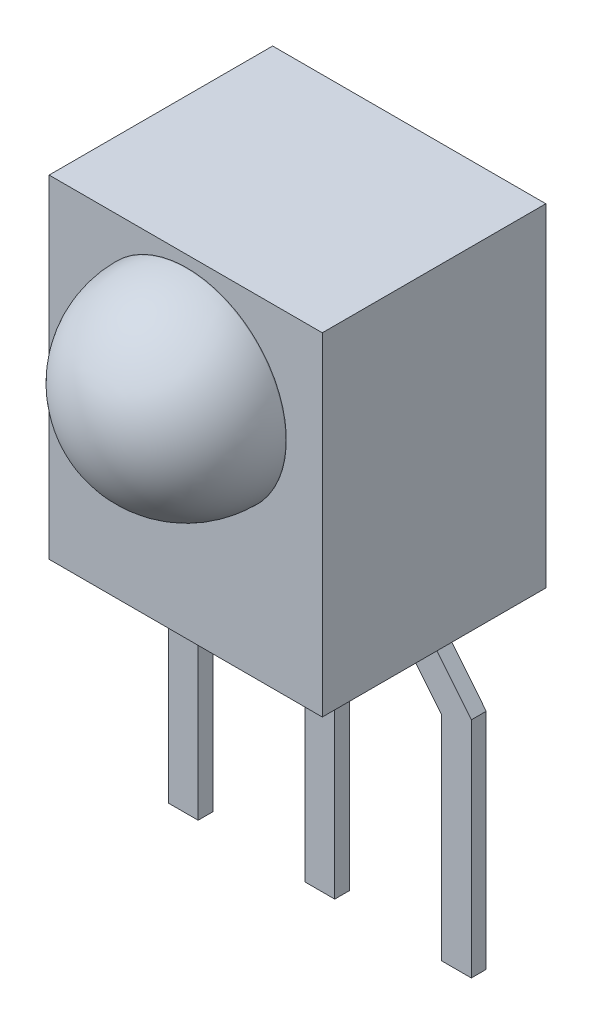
ISO-10303-21;
HEADER;
FILE_DESCRIPTION(('STEP AP214'),'2;1');
FILE_NAME('part.step','',(''),(''),'','','');
FILE_SCHEMA(('AUTOMOTIVE_DESIGN { 1 0 10303 214 1 1 1 1 }'));
ENDSEC;
DATA;
#1=APPLICATION_CONTEXT('core data for automotive mechanical design processes');
#2=APPLICATION_PROTOCOL_DEFINITION('international standard','automotive_design',2000,#1);
#3=PRODUCT_CONTEXT('',#1,'mechanical');
#4=PRODUCT('Part','Part','',(#3));
#5=PRODUCT_RELATED_PRODUCT_CATEGORY('part','',(#4));
#6=PRODUCT_DEFINITION_FORMATION('','',#4);
#7=PRODUCT_DEFINITION_CONTEXT('part definition',#1,'design');
#8=PRODUCT_DEFINITION('design','',#6,#7);
#9=PRODUCT_DEFINITION_SHAPE('','',#8);
#10=(LENGTH_UNIT() NAMED_UNIT(*) SI_UNIT(.MILLI.,.METRE.));
#11=(NAMED_UNIT(*) PLANE_ANGLE_UNIT() SI_UNIT($,.RADIAN.));
#12=(NAMED_UNIT(*) SI_UNIT($,.STERADIAN.) SOLID_ANGLE_UNIT());
#13=UNCERTAINTY_MEASURE_WITH_UNIT(LENGTH_MEASURE(1.E-05),#10,'distance_accuracy_value','');
#14=(GEOMETRIC_REPRESENTATION_CONTEXT(3) GLOBAL_UNCERTAINTY_ASSIGNED_CONTEXT((#13)) GLOBAL_UNIT_ASSIGNED_CONTEXT((#10,
#11,#12)) REPRESENTATION_CONTEXT('',''));
#15=CARTESIAN_POINT('',(0.,0.,0.));
#16=DIRECTION('',(0.,0.,1.));
#17=DIRECTION('',(1.,0.,0.));
#18=AXIS2_PLACEMENT_3D('',#15,#16,#17);
#19=CARTESIAN_POINT('',(-6.31661409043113,6.7,4.5));
#20=DIRECTION('',(0.,0.,-1.));
#21=DIRECTION('',(-1.,0.,0.));
#22=AXIS2_PLACEMENT_3D('',#19,#20,#21);
#23=PLANE('',#22);
#24=DIRECTION('',(0.,-1.,0.));
#25=VECTOR('',#24,1.);
#26=CARTESIAN_POINT('',(-6.31661409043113,0.,4.5));
#27=LINE('',#26,#25);
#28=CARTESIAN_POINT('',(-6.31661409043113,6.7,4.5));
#29=VERTEX_POINT('',#28);
#30=CARTESIAN_POINT('',(-6.31661409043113,0.,4.5));
#31=VERTEX_POINT('',#30);
#32=EDGE_CURVE('E312',#29,#31,#27,.T.);
#33=ORIENTED_EDGE('',*,*,#32,.T.);
#34=DIRECTION('',(1.,0.,0.));
#35=VECTOR('',#34,1.);
#36=CARTESIAN_POINT('',(-6.31661409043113,0.,4.5));
#37=LINE('',#36,#35);
#38=CARTESIAN_POINT('',(-0.816614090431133,0.,4.5));
#39=VERTEX_POINT('',#38);
#40=EDGE_CURVE('E315',#31,#39,#37,.T.);
#41=ORIENTED_EDGE('',*,*,#40,.T.);
#42=DIRECTION('',(0.,1.,0.));
#43=VECTOR('',#42,1.);
#44=CARTESIAN_POINT('',(-0.816614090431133,0.,4.5));
#45=LINE('',#44,#43);
#46=CARTESIAN_POINT('',(-0.816614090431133,6.7,4.5));
#47=VERTEX_POINT('',#46);
#48=EDGE_CURVE('E317',#39,#47,#45,.T.);
#49=ORIENTED_EDGE('',*,*,#48,.T.);
#50=DIRECTION('',(-1.,0.,0.));
#51=VECTOR('',#50,1.);
#52=CARTESIAN_POINT('',(-6.31661409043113,6.7,4.5));
#53=LINE('',#52,#51);
#54=EDGE_CURVE('E319',#47,#29,#53,.T.);
#55=ORIENTED_EDGE('',*,*,#54,.T.);
#56=EDGE_LOOP('',(#33,#41,#49,#55));
#57=FACE_BOUND('',#56,.T.);
#58=CARTESIAN_POINT('',(-3.54146732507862,4.46886413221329,4.5));
#59=DIRECTION('',(0.,0.,-1.));
#60=DIRECTION('',(-1.,0.,0.));
#61=AXIS2_PLACEMENT_3D('',#58,#59,#60);
#62=CIRCLE('',#61,2.);
#63=CARTESIAN_POINT('',(-5.54146732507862,4.46886413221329,4.5));
#64=VERTEX_POINT('',#63);
#65=EDGE_CURVE('E11',#64,#64,#62,.F.);
#66=ORIENTED_EDGE('',*,*,#65,.F.);
#67=EDGE_LOOP('',(#66));
#68=FACE_BOUND('',#67,.T.);
#69=ADVANCED_FACE('F31',(#57,#68),#23,.F.);
#70=CARTESIAN_POINT('',(-6.31661409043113,0.,4.5));
#71=DIRECTION('',(0.,1.,0.));
#72=DIRECTION('',(0.,0.,1.));
#73=AXIS2_PLACEMENT_3D('',#70,#71,#72);
#74=PLANE('',#73);
#75=DIRECTION('',(1.,0.,0.));
#76=VECTOR('',#75,1.);
#77=CARTESIAN_POINT('',(-5.61146018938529,0.,1.8));
#78=LINE('',#77,#76);
#79=CARTESIAN_POINT('',(-5.61146018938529,0.,1.8));
#80=VERTEX_POINT('',#79);
#81=CARTESIAN_POINT('',(-4.84123306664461,0.,1.8));
#82=VERTEX_POINT('',#81);
#83=EDGE_CURVE('E274',#80,#82,#78,.T.);
#84=ORIENTED_EDGE('',*,*,#83,.T.);
#85=DIRECTION('',(0.,0.,-1.));
#86=VECTOR('',#85,1.);
#87=CARTESIAN_POINT('',(-4.84123306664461,0.,1.8));
#88=LINE('',#87,#86);
#89=CARTESIAN_POINT('',(-4.84123306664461,0.,1.5));
#90=VERTEX_POINT('',#89);
#91=EDGE_CURVE('E299',#82,#90,#88,.T.);
#92=ORIENTED_EDGE('',*,*,#91,.T.);
#93=DIRECTION('',(1.,0.,0.));
#94=VECTOR('',#93,1.);
#95=CARTESIAN_POINT('',(-5.61146018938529,0.,1.5));
#96=LINE('',#95,#94);
#97=CARTESIAN_POINT('',(-5.61146018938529,0.,1.5));
#98=VERTEX_POINT('',#97);
#99=EDGE_CURVE('E256',#98,#90,#96,.T.);
#100=ORIENTED_EDGE('',*,*,#99,.F.);
#101=DIRECTION('',(0.,0.,-1.));
#102=VECTOR('',#101,1.);
#103=CARTESIAN_POINT('',(-5.61146018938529,0.,1.8));
#104=LINE('',#103,#102);
#105=EDGE_CURVE('E289',#80,#98,#104,.T.);
#106=ORIENTED_EDGE('',*,*,#105,.F.);
#107=EDGE_LOOP('',(#84,#92,#100,#106));
#108=FACE_BOUND('',#107,.T.);
#109=DIRECTION('',(1.,0.,0.));
#110=VECTOR('',#109,1.);
#111=CARTESIAN_POINT('',(-6.31661409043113,0.,0.));
#112=LINE('',#111,#110);
#113=CARTESIAN_POINT('',(-6.31661409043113,0.,0.));
#114=VERTEX_POINT('',#113);
#115=CARTESIAN_POINT('',(-0.816614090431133,0.,0.));
#116=VERTEX_POINT('',#115);
#117=EDGE_CURVE('E306',#114,#116,#112,.T.);
#118=ORIENTED_EDGE('',*,*,#117,.T.);
#119=DIRECTION('',(0.,0.,-1.));
#120=VECTOR('',#119,1.);
#121=CARTESIAN_POINT('',(-0.816614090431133,0.,4.5));
#122=LINE('',#121,#120);
#123=EDGE_CURVE('E327',#39,#116,#122,.T.);
#124=ORIENTED_EDGE('',*,*,#123,.F.);
#125=ORIENTED_EDGE('',*,*,#40,.F.);
#126=DIRECTION('',(0.,0.,-1.));
#127=VECTOR('',#126,1.);
#128=CARTESIAN_POINT('',(-6.31661409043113,0.,4.5));
#129=LINE('',#128,#127);
#130=EDGE_CURVE('E40',#31,#114,#129,.T.);
#131=ORIENTED_EDGE('',*,*,#130,.T.);
#132=EDGE_LOOP('',(#118,#124,#125,#131));
#133=FACE_BOUND('',#132,.T.);
#134=DIRECTION('',(0.,0.,-1.));
#135=VECTOR('',#134,1.);
#136=CARTESIAN_POINT('',(-2.29199511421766,0.,1.8));
#137=LINE('',#136,#135);
#138=CARTESIAN_POINT('',(-2.29199511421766,0.,1.8));
#139=VERTEX_POINT('',#138);
#140=CARTESIAN_POINT('',(-2.29199511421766,0.,1.5));
#141=VERTEX_POINT('',#140);
#142=EDGE_CURVE('E245',#139,#141,#137,.T.);
#143=ORIENTED_EDGE('',*,*,#142,.F.);
#144=DIRECTION('',(1.,0.,0.));
#145=VECTOR('',#144,1.);
#146=CARTESIAN_POINT('',(-1.52176799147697,0.,1.8));
#147=LINE('',#146,#145);
#148=CARTESIAN_POINT('',(-1.52176799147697,0.,1.8));
#149=VERTEX_POINT('',#148);
#150=EDGE_CURVE('E55',#139,#149,#147,.T.);
#151=ORIENTED_EDGE('',*,*,#150,.T.);
#152=DIRECTION('',(0.,0.,-1.));
#153=VECTOR('',#152,1.);
#154=CARTESIAN_POINT('',(-1.52176799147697,0.,1.8));
#155=LINE('',#154,#153);
#156=CARTESIAN_POINT('',(-1.52176799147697,0.,1.5));
#157=VERTEX_POINT('',#156);
#158=EDGE_CURVE('E242',#149,#157,#155,.T.);
#159=ORIENTED_EDGE('',*,*,#158,.T.);
#160=DIRECTION('',(1.,0.,0.));
#161=VECTOR('',#160,1.);
#162=CARTESIAN_POINT('',(-1.52176799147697,0.,1.5));
#163=LINE('',#162,#161);
#164=EDGE_CURVE('E222',#141,#157,#163,.T.);
#165=ORIENTED_EDGE('',*,*,#164,.F.);
#166=EDGE_LOOP('',(#143,#151,#159,#165));
#167=FACE_BOUND('',#166,.T.);
#168=DIRECTION('',(1.,0.,0.));
#169=VECTOR('',#168,1.);
#170=CARTESIAN_POINT('',(-3.86661409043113,0.,1.8));
#171=LINE('',#170,#169);
#172=CARTESIAN_POINT('',(-3.86661409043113,0.,1.8));
#173=VERTEX_POINT('',#172);
#174=CARTESIAN_POINT('',(-3.26661409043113,0.,1.8));
#175=VERTEX_POINT('',#174);
#176=EDGE_CURVE('E181',#173,#175,#171,.T.);
#177=ORIENTED_EDGE('',*,*,#176,.T.);
#178=DIRECTION('',(0.,0.,-1.));
#179=VECTOR('',#178,1.);
#180=CARTESIAN_POINT('',(-3.26661409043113,0.,1.8));
#181=LINE('',#180,#179);
#182=CARTESIAN_POINT('',(-3.26661409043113,0.,1.5));
#183=VERTEX_POINT('',#182);
#184=EDGE_CURVE('E202',#175,#183,#181,.T.);
#185=ORIENTED_EDGE('',*,*,#184,.T.);
#186=DIRECTION('',(1.,0.,0.));
#187=VECTOR('',#186,1.);
#188=CARTESIAN_POINT('',(-3.86661409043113,0.,1.5));
#189=LINE('',#188,#187);
#190=CARTESIAN_POINT('',(-3.86661409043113,0.,1.5));
#191=VERTEX_POINT('',#190);
#192=EDGE_CURVE('E188',#191,#183,#189,.T.);
#193=ORIENTED_EDGE('',*,*,#192,.F.);
#194=DIRECTION('',(0.,0.,-1.));
#195=VECTOR('',#194,1.);
#196=CARTESIAN_POINT('',(-3.86661409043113,0.,1.8));
#197=LINE('',#196,#195);
#198=EDGE_CURVE('E205',#173,#191,#197,.T.);
#199=ORIENTED_EDGE('',*,*,#198,.F.);
#200=EDGE_LOOP('',(#177,#185,#193,#199));
#201=FACE_BOUND('',#200,.T.);
#202=ADVANCED_FACE('F333',(#108,#133,#167,#201),#74,.F.);
#203=CARTESIAN_POINT('',(-6.31661409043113,0.,4.5));
#204=DIRECTION('',(1.,0.,0.));
#205=DIRECTION('',(0.,0.,-1.));
#206=AXIS2_PLACEMENT_3D('',#203,#204,#205);
#207=PLANE('',#206);
#208=DIRECTION('',(0.,-1.,0.));
#209=VECTOR('',#208,1.);
#210=CARTESIAN_POINT('',(-6.31661409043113,0.,0.));
#211=LINE('',#210,#209);
#212=CARTESIAN_POINT('',(-6.31661409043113,6.7,0.));
#213=VERTEX_POINT('',#212);
#214=EDGE_CURVE('E292',#213,#114,#211,.T.);
#215=ORIENTED_EDGE('',*,*,#214,.T.);
#216=ORIENTED_EDGE('',*,*,#130,.F.);
#217=ORIENTED_EDGE('',*,*,#32,.F.);
#218=DIRECTION('',(0.,0.,-1.));
#219=VECTOR('',#218,1.);
#220=CARTESIAN_POINT('',(-6.31661409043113,6.7,4.5));
#221=LINE('',#220,#219);
#222=EDGE_CURVE('E321',#29,#213,#221,.T.);
#223=ORIENTED_EDGE('',*,*,#222,.T.);
#224=EDGE_LOOP('',(#215,#216,#217,#223));
#225=FACE_BOUND('',#224,.T.);
#226=ADVANCED_FACE('F338',(#225),#207,.F.);
#227=CARTESIAN_POINT('',(-0.816614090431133,0.,4.5));
#228=DIRECTION('',(-1.,0.,0.));
#229=DIRECTION('',(0.,0.,1.));
#230=AXIS2_PLACEMENT_3D('',#227,#228,#229);
#231=PLANE('',#230);
#232=DIRECTION('',(0.,1.,0.));
#233=VECTOR('',#232,1.);
#234=CARTESIAN_POINT('',(-0.816614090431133,0.,0.));
#235=LINE('',#234,#233);
#236=CARTESIAN_POINT('',(-0.816614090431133,6.7,0.));
#237=VERTEX_POINT('',#236);
#238=EDGE_CURVE('E308',#116,#237,#235,.T.);
#239=ORIENTED_EDGE('',*,*,#238,.T.);
#240=DIRECTION('',(0.,0.,-1.));
#241=VECTOR('',#240,1.);
#242=CARTESIAN_POINT('',(-0.816614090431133,6.7,4.5));
#243=LINE('',#242,#241);
#244=EDGE_CURVE('E324',#47,#237,#243,.T.);
#245=ORIENTED_EDGE('',*,*,#244,.F.);
#246=ORIENTED_EDGE('',*,*,#48,.F.);
#247=ORIENTED_EDGE('',*,*,#123,.T.);
#248=EDGE_LOOP('',(#239,#245,#246,#247));
#249=FACE_BOUND('',#248,.T.);
#250=ADVANCED_FACE('F346',(#249),#231,.F.);
#251=CARTESIAN_POINT('',(-6.31661409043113,6.7,4.5));
#252=DIRECTION('',(0.,-1.,0.));
#253=DIRECTION('',(0.,0.,-1.));
#254=AXIS2_PLACEMENT_3D('',#251,#252,#253);
#255=PLANE('',#254);
#256=DIRECTION('',(-1.,0.,0.));
#257=VECTOR('',#256,1.);
#258=CARTESIAN_POINT('',(-6.31661409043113,6.7,0.));
#259=LINE('',#258,#257);
#260=EDGE_CURVE('E310',#237,#213,#259,.T.);
#261=ORIENTED_EDGE('',*,*,#260,.T.);
#262=ORIENTED_EDGE('',*,*,#222,.F.);
#263=ORIENTED_EDGE('',*,*,#54,.F.);
#264=ORIENTED_EDGE('',*,*,#244,.T.);
#265=EDGE_LOOP('',(#261,#262,#263,#264));
#266=FACE_BOUND('',#265,.T.);
#267=ADVANCED_FACE('F350',(#266),#255,.F.);
#268=CARTESIAN_POINT('',(-6.31661409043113,6.7,0.));
#269=DIRECTION('',(0.,0.,-1.));
#270=DIRECTION('',(-1.,0.,0.));
#271=AXIS2_PLACEMENT_3D('',#268,#269,#270);
#272=PLANE('',#271);
#273=ORIENTED_EDGE('',*,*,#214,.F.);
#274=ORIENTED_EDGE('',*,*,#260,.F.);
#275=ORIENTED_EDGE('',*,*,#238,.F.);
#276=ORIENTED_EDGE('',*,*,#117,.F.);
#277=EDGE_LOOP('',(#273,#274,#275,#276));
#278=FACE_BOUND('',#277,.T.);
#279=ADVANCED_FACE('F342',(#278),#272,.T.);
#280=CARTESIAN_POINT('',(-5.61146018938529,0.,1.8));
#281=DIRECTION('',(-0.77899100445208,0.627035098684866,0.));
#282=DIRECTION('',(-0.627035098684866,-0.77899100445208,0.));
#283=AXIS2_PLACEMENT_3D('',#280,#281,#282);
#284=PLANE('',#283);
#285=DIRECTION('',(0.627035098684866,0.77899100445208,0.));
#286=VECTOR('',#285,1.);
#287=CARTESIAN_POINT('',(-5.61146018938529,0.,1.5));
#288=LINE('',#287,#286);
#289=CARTESIAN_POINT('',(-6.61661409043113,-1.24874325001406,1.5));
#290=VERTEX_POINT('',#289);
#291=EDGE_CURVE('E244',#290,#98,#288,.T.);
#292=ORIENTED_EDGE('',*,*,#291,.F.);
#293=DIRECTION('',(0.,0.,-1.));
#294=VECTOR('',#293,1.);
#295=CARTESIAN_POINT('',(-6.61661409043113,-1.24874325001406,1.8));
#296=LINE('',#295,#294);
#297=CARTESIAN_POINT('',(-6.61661409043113,-1.24874325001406,1.8));
#298=VERTEX_POINT('',#297);
#299=EDGE_CURVE('E290',#298,#290,#296,.T.);
#300=ORIENTED_EDGE('',*,*,#299,.F.);
#301=DIRECTION('',(0.627035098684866,0.77899100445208,0.));
#302=VECTOR('',#301,1.);
#303=CARTESIAN_POINT('',(-5.61146018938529,0.,1.8));
#304=LINE('',#303,#302);
#305=EDGE_CURVE('E271',#298,#80,#304,.T.);
#306=ORIENTED_EDGE('',*,*,#305,.T.);
#307=ORIENTED_EDGE('',*,*,#105,.T.);
#308=EDGE_LOOP('',(#292,#300,#306,#307));
#309=FACE_BOUND('',#308,.T.);
#310=ADVANCED_FACE('F422',(#309),#284,.T.);
#311=CARTESIAN_POINT('',(-6.61661409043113,-1.24874325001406,1.8));
#312=DIRECTION('',(-1.,0.,0.));
#313=DIRECTION('',(0.,0.,1.));
#314=AXIS2_PLACEMENT_3D('',#311,#312,#313);
#315=PLANE('',#314);
#316=DIRECTION('',(0.,1.,0.));
#317=VECTOR('',#316,1.);
#318=CARTESIAN_POINT('',(-6.61661409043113,-1.24874325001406,1.5));
#319=LINE('',#318,#317);
#320=CARTESIAN_POINT('',(-6.61661409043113,-5.7499128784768,1.5));
#321=VERTEX_POINT('',#320);
#322=EDGE_CURVE('E268',#321,#290,#319,.T.);
#323=ORIENTED_EDGE('',*,*,#322,.F.);
#324=DIRECTION('',(0.,0.,-1.));
#325=VECTOR('',#324,1.);
#326=CARTESIAN_POINT('',(-6.61661409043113,-5.7499128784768,1.8));
#327=LINE('',#326,#325);
#328=CARTESIAN_POINT('',(-6.61661409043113,-5.7499128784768,1.8));
#329=VERTEX_POINT('',#328);
#330=EDGE_CURVE('E293',#329,#321,#327,.T.);
#331=ORIENTED_EDGE('',*,*,#330,.F.);
#332=DIRECTION('',(0.,1.,0.));
#333=VECTOR('',#332,1.);
#334=CARTESIAN_POINT('',(-6.61661409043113,-1.24874325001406,1.8));
#335=LINE('',#334,#333);
#336=EDGE_CURVE('E286',#329,#298,#335,.T.);
#337=ORIENTED_EDGE('',*,*,#336,.T.);
#338=ORIENTED_EDGE('',*,*,#299,.T.);
#339=EDGE_LOOP('',(#323,#331,#337,#338));
#340=FACE_BOUND('',#339,.T.);
#341=ADVANCED_FACE('F418',(#340),#315,.T.);
#342=CARTESIAN_POINT('',(-6.01661409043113,-5.7499128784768,1.8));
#343=DIRECTION('',(0.,-1.,0.));
#344=DIRECTION('',(0.,0.,-1.));
#345=AXIS2_PLACEMENT_3D('',#342,#343,#344);
#346=PLANE('',#345);
#347=DIRECTION('',(-1.,0.,0.));
#348=VECTOR('',#347,1.);
#349=CARTESIAN_POINT('',(-6.01661409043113,-5.7499128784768,1.5));
#350=LINE('',#349,#348);
#351=CARTESIAN_POINT('',(-6.01661409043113,-5.7499128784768,1.5));
#352=VERTEX_POINT('',#351);
#353=EDGE_CURVE('E265',#352,#321,#350,.T.);
#354=ORIENTED_EDGE('',*,*,#353,.F.);
#355=DIRECTION('',(0.,0.,-1.));
#356=VECTOR('',#355,1.);
#357=CARTESIAN_POINT('',(-6.01661409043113,-5.7499128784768,1.8));
#358=LINE('',#357,#356);
#359=CARTESIAN_POINT('',(-6.01661409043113,-5.7499128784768,1.8));
#360=VERTEX_POINT('',#359);
#361=EDGE_CURVE('E295',#360,#352,#358,.T.);
#362=ORIENTED_EDGE('',*,*,#361,.F.);
#363=DIRECTION('',(-1.,0.,0.));
#364=VECTOR('',#363,1.);
#365=CARTESIAN_POINT('',(-6.01661409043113,-5.7499128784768,1.8));
#366=LINE('',#365,#364);
#367=EDGE_CURVE('E283',#360,#329,#366,.T.);
#368=ORIENTED_EDGE('',*,*,#367,.T.);
#369=ORIENTED_EDGE('',*,*,#330,.T.);
#370=EDGE_LOOP('',(#354,#362,#368,#369));
#371=FACE_BOUND('',#370,.T.);
#372=ADVANCED_FACE('F421',(#371),#346,.T.);
#373=CARTESIAN_POINT('',(-6.01661409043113,-1.46022327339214,1.8));
#374=DIRECTION('',(1.,0.,0.));
#375=DIRECTION('',(0.,0.,-1.));
#376=AXIS2_PLACEMENT_3D('',#373,#374,#375);
#377=PLANE('',#376);
#378=DIRECTION('',(0.,-1.,0.));
#379=VECTOR('',#378,1.);
#380=CARTESIAN_POINT('',(-6.01661409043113,-1.46022327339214,1.5));
#381=LINE('',#380,#379);
#382=CARTESIAN_POINT('',(-6.01661409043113,-1.46022327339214,1.5));
#383=VERTEX_POINT('',#382);
#384=EDGE_CURVE('E262',#383,#352,#381,.T.);
#385=ORIENTED_EDGE('',*,*,#384,.F.);
#386=DIRECTION('',(0.,0.,-1.));
#387=VECTOR('',#386,1.);
#388=CARTESIAN_POINT('',(-6.01661409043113,-1.46022327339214,1.8));
#389=LINE('',#388,#387);
#390=CARTESIAN_POINT('',(-6.01661409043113,-1.46022327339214,1.8));
#391=VERTEX_POINT('',#390);
#392=EDGE_CURVE('E297',#391,#383,#389,.T.);
#393=ORIENTED_EDGE('',*,*,#392,.F.);
#394=DIRECTION('',(0.,-1.,0.));
#395=VECTOR('',#394,1.);
#396=CARTESIAN_POINT('',(-6.01661409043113,-1.46022327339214,1.8));
#397=LINE('',#396,#395);
#398=EDGE_CURVE('E280',#391,#360,#397,.T.);
#399=ORIENTED_EDGE('',*,*,#398,.T.);
#400=ORIENTED_EDGE('',*,*,#361,.T.);
#401=EDGE_LOOP('',(#385,#393,#399,#400));
#402=FACE_BOUND('',#401,.T.);
#403=ADVANCED_FACE('F426',(#402),#377,.T.);
#404=CARTESIAN_POINT('',(-4.84123306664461,0.,1.8));
#405=DIRECTION('',(0.77899100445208,-0.627035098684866,0.));
#406=DIRECTION('',(0.627035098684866,0.77899100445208,0.));
#407=AXIS2_PLACEMENT_3D('',#404,#405,#406);
#408=PLANE('',#407);
#409=DIRECTION('',(-0.627035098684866,-0.77899100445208,0.));
#410=VECTOR('',#409,1.);
#411=CARTESIAN_POINT('',(-4.84123306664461,0.,1.5));
#412=LINE('',#411,#410);
#413=EDGE_CURVE('E259',#90,#383,#412,.T.);
#414=ORIENTED_EDGE('',*,*,#413,.F.);
#415=ORIENTED_EDGE('',*,*,#91,.F.);
#416=DIRECTION('',(-0.627035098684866,-0.77899100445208,0.));
#417=VECTOR('',#416,1.);
#418=CARTESIAN_POINT('',(-4.84123306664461,0.,1.8));
#419=LINE('',#418,#417);
#420=EDGE_CURVE('E277',#82,#391,#419,.T.);
#421=ORIENTED_EDGE('',*,*,#420,.T.);
#422=ORIENTED_EDGE('',*,*,#392,.T.);
#423=EDGE_LOOP('',(#414,#415,#421,#422));
#424=FACE_BOUND('',#423,.T.);
#425=ADVANCED_FACE('F416',(#424),#408,.T.);
#426=CARTESIAN_POINT('',(-10.2397513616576,-5.7499128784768,1.8));
#427=DIRECTION('',(0.,0.,-1.));
#428=DIRECTION('',(-1.,0.,0.));
#429=AXIS2_PLACEMENT_3D('',#426,#427,#428);
#430=PLANE('',#429);
#431=ORIENTED_EDGE('',*,*,#305,.F.);
#432=ORIENTED_EDGE('',*,*,#336,.F.);
#433=ORIENTED_EDGE('',*,*,#367,.F.);
#434=ORIENTED_EDGE('',*,*,#398,.F.);
#435=ORIENTED_EDGE('',*,*,#420,.F.);
#436=ORIENTED_EDGE('',*,*,#83,.F.);
#437=EDGE_LOOP('',(#431,#432,#433,#434,#435,#436));
#438=FACE_BOUND('',#437,.T.);
#439=ADVANCED_FACE('F412',(#438),#430,.F.);
#440=CARTESIAN_POINT('',(-10.2397513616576,-5.7499128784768,1.5));
#441=DIRECTION('',(0.,0.,-1.));
#442=DIRECTION('',(-1.,0.,0.));
#443=AXIS2_PLACEMENT_3D('',#440,#441,#442);
#444=PLANE('',#443);
#445=ORIENTED_EDGE('',*,*,#291,.T.);
#446=ORIENTED_EDGE('',*,*,#99,.T.);
#447=ORIENTED_EDGE('',*,*,#413,.T.);
#448=ORIENTED_EDGE('',*,*,#384,.T.);
#449=ORIENTED_EDGE('',*,*,#353,.T.);
#450=ORIENTED_EDGE('',*,*,#322,.T.);
#451=EDGE_LOOP('',(#445,#446,#447,#448,#449,#450));
#452=FACE_BOUND('',#451,.T.);
#453=ADVANCED_FACE('F408',(#452),#444,.T.);
#454=CARTESIAN_POINT('',(-1.52176799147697,0.,1.8));
#455=DIRECTION('',(0.77899100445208,0.627035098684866,0.));
#456=DIRECTION('',(-0.627035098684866,0.77899100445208,0.));
#457=AXIS2_PLACEMENT_3D('',#454,#455,#456);
#458=PLANE('',#457);
#459=DIRECTION('',(0.627035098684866,-0.77899100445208,0.));
#460=VECTOR('',#459,1.);
#461=CARTESIAN_POINT('',(-1.52176799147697,0.,1.5));
#462=LINE('',#461,#460);
#463=CARTESIAN_POINT('',(-0.516614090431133,-1.24874325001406,1.5));
#464=VERTEX_POINT('',#463);
#465=EDGE_CURVE('E204',#157,#464,#462,.T.);
#466=ORIENTED_EDGE('',*,*,#465,.F.);
#467=ORIENTED_EDGE('',*,*,#158,.F.);
#468=DIRECTION('',(0.627035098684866,-0.77899100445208,0.));
#469=VECTOR('',#468,1.);
#470=CARTESIAN_POINT('',(-1.52176799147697,0.,1.8));
#471=LINE('',#470,#469);
#472=CARTESIAN_POINT('',(-0.516614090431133,-1.24874325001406,1.8));
#473=VERTEX_POINT('',#472);
#474=EDGE_CURVE('E225',#149,#473,#471,.T.);
#475=ORIENTED_EDGE('',*,*,#474,.T.);
#476=DIRECTION('',(0.,0.,-1.));
#477=VECTOR('',#476,1.);
#478=CARTESIAN_POINT('',(-0.516614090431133,-1.24874325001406,1.8));
#479=LINE('',#478,#477);
#480=EDGE_CURVE('E241',#473,#464,#479,.T.);
#481=ORIENTED_EDGE('',*,*,#480,.T.);
#482=EDGE_LOOP('',(#466,#467,#475,#481));
#483=FACE_BOUND('',#482,.T.);
#484=ADVANCED_FACE('F394',(#483),#458,.T.);
#485=CARTESIAN_POINT('',(-2.29199511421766,0.,1.8));
#486=DIRECTION('',(-0.77899100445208,-0.627035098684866,0.));
#487=DIRECTION('',(0.627035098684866,-0.77899100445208,0.));
#488=AXIS2_PLACEMENT_3D('',#485,#486,#487);
#489=PLANE('',#488);
#490=DIRECTION('',(-0.627035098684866,0.77899100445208,0.));
#491=VECTOR('',#490,1.);
#492=CARTESIAN_POINT('',(-2.29199511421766,0.,1.5));
#493=LINE('',#492,#491);
#494=CARTESIAN_POINT('',(-1.11661409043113,-1.46022327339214,1.5));
#495=VERTEX_POINT('',#494);
#496=EDGE_CURVE('E219',#495,#141,#493,.T.);
#497=ORIENTED_EDGE('',*,*,#496,.F.);
#498=DIRECTION('',(0.,0.,-1.));
#499=VECTOR('',#498,1.);
#500=CARTESIAN_POINT('',(-1.11661409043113,-1.46022327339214,1.8));
#501=LINE('',#500,#499);
#502=CARTESIAN_POINT('',(-1.11661409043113,-1.46022327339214,1.8));
#503=VERTEX_POINT('',#502);
#504=EDGE_CURVE('E248',#503,#495,#501,.T.);
#505=ORIENTED_EDGE('',*,*,#504,.F.);
#506=DIRECTION('',(-0.627035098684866,0.77899100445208,0.));
#507=VECTOR('',#506,1.);
#508=CARTESIAN_POINT('',(-2.29199511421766,0.,1.8));
#509=LINE('',#508,#507);
#510=EDGE_CURVE('E237',#503,#139,#509,.T.);
#511=ORIENTED_EDGE('',*,*,#510,.T.);
#512=ORIENTED_EDGE('',*,*,#142,.T.);
#513=EDGE_LOOP('',(#497,#505,#511,#512));
#514=FACE_BOUND('',#513,.T.);
#515=ADVANCED_FACE('F390',(#514),#489,.T.);
#516=CARTESIAN_POINT('',(-1.11661409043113,-1.46022327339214,1.8));
#517=DIRECTION('',(-1.,0.,0.));
#518=DIRECTION('',(0.,0.,1.));
#519=AXIS2_PLACEMENT_3D('',#516,#517,#518);
#520=PLANE('',#519);
#521=DIRECTION('',(0.,1.,0.));
#522=VECTOR('',#521,1.);
#523=CARTESIAN_POINT('',(-1.11661409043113,-1.46022327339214,1.5));
#524=LINE('',#523,#522);
#525=CARTESIAN_POINT('',(-1.11661409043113,-5.7499128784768,1.5));
#526=VERTEX_POINT('',#525);
#527=EDGE_CURVE('E216',#526,#495,#524,.T.);
#528=ORIENTED_EDGE('',*,*,#527,.F.);
#529=DIRECTION('',(0.,0.,-1.));
#530=VECTOR('',#529,1.);
#531=CARTESIAN_POINT('',(-1.11661409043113,-5.7499128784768,1.8));
#532=LINE('',#531,#530);
#533=CARTESIAN_POINT('',(-1.11661409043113,-5.7499128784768,1.8));
#534=VERTEX_POINT('',#533);
#535=EDGE_CURVE('E250',#534,#526,#532,.T.);
#536=ORIENTED_EDGE('',*,*,#535,.F.);
#537=DIRECTION('',(0.,1.,0.));
#538=VECTOR('',#537,1.);
#539=CARTESIAN_POINT('',(-1.11661409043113,-1.46022327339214,1.8));
#540=LINE('',#539,#538);
#541=EDGE_CURVE('E234',#534,#503,#540,.T.);
#542=ORIENTED_EDGE('',*,*,#541,.T.);
#543=ORIENTED_EDGE('',*,*,#504,.T.);
#544=EDGE_LOOP('',(#528,#536,#542,#543));
#545=FACE_BOUND('',#544,.T.);
#546=ADVANCED_FACE('F393',(#545),#520,.T.);
#547=CARTESIAN_POINT('',(-1.11661409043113,-5.7499128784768,1.8));
#548=DIRECTION('',(0.,-1.,0.));
#549=DIRECTION('',(0.,0.,-1.));
#550=AXIS2_PLACEMENT_3D('',#547,#548,#549);
#551=PLANE('',#550);
#552=DIRECTION('',(-1.,0.,0.));
#553=VECTOR('',#552,1.);
#554=CARTESIAN_POINT('',(-1.11661409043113,-5.7499128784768,1.5));
#555=LINE('',#554,#553);
#556=CARTESIAN_POINT('',(-0.516614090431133,-5.7499128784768,1.5));
#557=VERTEX_POINT('',#556);
#558=EDGE_CURVE('E213',#557,#526,#555,.T.);
#559=ORIENTED_EDGE('',*,*,#558,.F.);
#560=DIRECTION('',(0.,0.,-1.));
#561=VECTOR('',#560,1.);
#562=CARTESIAN_POINT('',(-0.516614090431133,-5.7499128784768,1.8));
#563=LINE('',#562,#561);
#564=CARTESIAN_POINT('',(-0.516614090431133,-5.7499128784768,1.8));
#565=VERTEX_POINT('',#564);
#566=EDGE_CURVE('E252',#565,#557,#563,.T.);
#567=ORIENTED_EDGE('',*,*,#566,.F.);
#568=DIRECTION('',(-1.,0.,0.));
#569=VECTOR('',#568,1.);
#570=CARTESIAN_POINT('',(-1.11661409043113,-5.7499128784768,1.8));
#571=LINE('',#570,#569);
#572=EDGE_CURVE('E231',#565,#534,#571,.T.);
#573=ORIENTED_EDGE('',*,*,#572,.T.);
#574=ORIENTED_EDGE('',*,*,#535,.T.);
#575=EDGE_LOOP('',(#559,#567,#573,#574));
#576=FACE_BOUND('',#575,.T.);
#577=ADVANCED_FACE('F398',(#576),#551,.T.);
#578=CARTESIAN_POINT('',(-0.516614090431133,-1.24874325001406,1.8));
#579=DIRECTION('',(1.,0.,0.));
#580=DIRECTION('',(0.,0.,-1.));
#581=AXIS2_PLACEMENT_3D('',#578,#579,#580);
#582=PLANE('',#581);
#583=DIRECTION('',(0.,-1.,0.));
#584=VECTOR('',#583,1.);
#585=CARTESIAN_POINT('',(-0.516614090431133,-1.24874325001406,1.5));
#586=LINE('',#585,#584);
#587=EDGE_CURVE('E210',#464,#557,#586,.T.);
#588=ORIENTED_EDGE('',*,*,#587,.F.);
#589=ORIENTED_EDGE('',*,*,#480,.F.);
#590=DIRECTION('',(0.,-1.,0.));
#591=VECTOR('',#590,1.);
#592=CARTESIAN_POINT('',(-0.516614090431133,-1.24874325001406,1.8));
#593=LINE('',#592,#591);
#594=EDGE_CURVE('E228',#473,#565,#593,.T.);
#595=ORIENTED_EDGE('',*,*,#594,.T.);
#596=ORIENTED_EDGE('',*,*,#566,.T.);
#597=EDGE_LOOP('',(#588,#589,#595,#596));
#598=FACE_BOUND('',#597,.T.);
#599=ADVANCED_FACE('F388',(#598),#582,.T.);
#600=CARTESIAN_POINT('',(3.10652318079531,-5.7499128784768,1.8));
#601=DIRECTION('',(0.,0.,1.));
#602=DIRECTION('',(1.,0.,0.));
#603=AXIS2_PLACEMENT_3D('',#600,#601,#602);
#604=PLANE('',#603);
#605=ORIENTED_EDGE('',*,*,#474,.F.);
#606=ORIENTED_EDGE('',*,*,#150,.F.);
#607=ORIENTED_EDGE('',*,*,#510,.F.);
#608=ORIENTED_EDGE('',*,*,#541,.F.);
#609=ORIENTED_EDGE('',*,*,#572,.F.);
#610=ORIENTED_EDGE('',*,*,#594,.F.);
#611=EDGE_LOOP('',(#605,#606,#607,#608,#609,#610));
#612=FACE_BOUND('',#611,.T.);
#613=ADVANCED_FACE('F384',(#612),#604,.T.);
#614=CARTESIAN_POINT('',(3.10652318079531,-5.7499128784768,1.5));
#615=DIRECTION('',(0.,0.,1.));
#616=DIRECTION('',(1.,0.,0.));
#617=AXIS2_PLACEMENT_3D('',#614,#615,#616);
#618=PLANE('',#617);
#619=ORIENTED_EDGE('',*,*,#465,.T.);
#620=ORIENTED_EDGE('',*,*,#587,.T.);
#621=ORIENTED_EDGE('',*,*,#558,.T.);
#622=ORIENTED_EDGE('',*,*,#527,.T.);
#623=ORIENTED_EDGE('',*,*,#496,.T.);
#624=ORIENTED_EDGE('',*,*,#164,.T.);
#625=EDGE_LOOP('',(#619,#620,#621,#622,#623,#624));
#626=FACE_BOUND('',#625,.T.);
#627=ADVANCED_FACE('F381',(#626),#618,.F.);
#628=CARTESIAN_POINT('',(-3.26661409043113,0.,1.8));
#629=DIRECTION('',(1.,0.,0.));
#630=DIRECTION('',(0.,0.,-1.));
#631=AXIS2_PLACEMENT_3D('',#628,#629,#630);
#632=PLANE('',#631);
#633=DIRECTION('',(0.,-1.,0.));
#634=VECTOR('',#633,1.);
#635=CARTESIAN_POINT('',(-3.26661409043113,0.,1.5));
#636=LINE('',#635,#634);
#637=CARTESIAN_POINT('',(-3.26661409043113,-5.7499128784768,1.5));
#638=VERTEX_POINT('',#637);
#639=EDGE_CURVE('E174',#183,#638,#636,.T.);
#640=ORIENTED_EDGE('',*,*,#639,.F.);
#641=ORIENTED_EDGE('',*,*,#184,.F.);
#642=DIRECTION('',(0.,-1.,0.));
#643=VECTOR('',#642,1.);
#644=CARTESIAN_POINT('',(-3.26661409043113,0.,1.8));
#645=LINE('',#644,#643);
#646=CARTESIAN_POINT('',(-3.26661409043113,-5.7499128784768,1.8));
#647=VERTEX_POINT('',#646);
#648=EDGE_CURVE('E176',#175,#647,#645,.T.);
#649=ORIENTED_EDGE('',*,*,#648,.T.);
#650=DIRECTION('',(0.,0.,-1.));
#651=VECTOR('',#650,1.);
#652=CARTESIAN_POINT('',(-3.26661409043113,-5.7499128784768,1.8));
#653=LINE('',#652,#651);
#654=EDGE_CURVE('E170',#647,#638,#653,.T.);
#655=ORIENTED_EDGE('',*,*,#654,.T.);
#656=EDGE_LOOP('',(#640,#641,#649,#655));
#657=FACE_BOUND('',#656,.T.);
#658=ADVANCED_FACE('F172',(#657),#632,.T.);
#659=CARTESIAN_POINT('',(-3.86661409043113,0.,1.8));
#660=DIRECTION('',(-1.,0.,0.));
#661=DIRECTION('',(0.,0.,1.));
#662=AXIS2_PLACEMENT_3D('',#659,#660,#661);
#663=PLANE('',#662);
#664=DIRECTION('',(0.,1.,0.));
#665=VECTOR('',#664,1.);
#666=CARTESIAN_POINT('',(-3.86661409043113,0.,1.5));
#667=LINE('',#666,#665);
#668=CARTESIAN_POINT('',(-3.86661409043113,-5.7499128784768,1.5));
#669=VERTEX_POINT('',#668);
#670=EDGE_CURVE('E47',#669,#191,#667,.T.);
#671=ORIENTED_EDGE('',*,*,#670,.F.);
#672=DIRECTION('',(0.,0.,-1.));
#673=VECTOR('',#672,1.);
#674=CARTESIAN_POINT('',(-3.86661409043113,-5.7499128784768,1.8));
#675=LINE('',#674,#673);
#676=CARTESIAN_POINT('',(-3.86661409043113,-5.7499128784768,1.8));
#677=VERTEX_POINT('',#676);
#678=EDGE_CURVE('E180',#677,#669,#675,.T.);
#679=ORIENTED_EDGE('',*,*,#678,.F.);
#680=DIRECTION('',(0.,1.,0.));
#681=VECTOR('',#680,1.);
#682=CARTESIAN_POINT('',(-3.86661409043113,0.,1.8));
#683=LINE('',#682,#681);
#684=EDGE_CURVE('E198',#677,#173,#683,.T.);
#685=ORIENTED_EDGE('',*,*,#684,.T.);
#686=ORIENTED_EDGE('',*,*,#198,.T.);
#687=EDGE_LOOP('',(#671,#679,#685,#686));
#688=FACE_BOUND('',#687,.T.);
#689=ADVANCED_FACE('F373',(#688),#663,.T.);
#690=CARTESIAN_POINT('',(-3.26661409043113,-5.7499128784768,1.8));
#691=DIRECTION('',(0.,-1.,0.));
#692=DIRECTION('',(0.,0.,-1.));
#693=AXIS2_PLACEMENT_3D('',#690,#691,#692);
#694=PLANE('',#693);
#695=DIRECTION('',(-1.,0.,0.));
#696=VECTOR('',#695,1.);
#697=CARTESIAN_POINT('',(-3.26661409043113,-5.7499128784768,1.5));
#698=LINE('',#697,#696);
#699=EDGE_CURVE('E183',#638,#669,#698,.T.);
#700=ORIENTED_EDGE('',*,*,#699,.F.);
#701=ORIENTED_EDGE('',*,*,#654,.F.);
#702=DIRECTION('',(-1.,0.,0.));
#703=VECTOR('',#702,1.);
#704=CARTESIAN_POINT('',(-3.26661409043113,-5.7499128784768,1.8));
#705=LINE('',#704,#703);
#706=EDGE_CURVE('E196',#647,#677,#705,.T.);
#707=ORIENTED_EDGE('',*,*,#706,.T.);
#708=ORIENTED_EDGE('',*,*,#678,.T.);
#709=EDGE_LOOP('',(#700,#701,#707,#708));
#710=FACE_BOUND('',#709,.T.);
#711=ADVANCED_FACE('F184',(#710),#694,.T.);
#712=CARTESIAN_POINT('',(-3.26661409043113,-5.7499128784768,1.8));
#713=DIRECTION('',(0.,0.,-1.));
#714=DIRECTION('',(-1.,0.,0.));
#715=AXIS2_PLACEMENT_3D('',#712,#713,#714);
#716=PLANE('',#715);
#717=ORIENTED_EDGE('',*,*,#648,.F.);
#718=ORIENTED_EDGE('',*,*,#176,.F.);
#719=ORIENTED_EDGE('',*,*,#684,.F.);
#720=ORIENTED_EDGE('',*,*,#706,.F.);
#721=EDGE_LOOP('',(#717,#718,#719,#720));
#722=FACE_BOUND('',#721,.T.);
#723=ADVANCED_FACE('F366',(#722),#716,.F.);
#724=CARTESIAN_POINT('',(-3.26661409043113,-5.7499128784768,1.5));
#725=DIRECTION('',(0.,0.,-1.));
#726=DIRECTION('',(-1.,0.,0.));
#727=AXIS2_PLACEMENT_3D('',#724,#725,#726);
#728=PLANE('',#727);
#729=ORIENTED_EDGE('',*,*,#639,.T.);
#730=ORIENTED_EDGE('',*,*,#699,.T.);
#731=ORIENTED_EDGE('',*,*,#670,.T.);
#732=ORIENTED_EDGE('',*,*,#192,.T.);
#733=EDGE_LOOP('',(#729,#730,#731,#732));
#734=FACE_BOUND('',#733,.T.);
#735=ADVANCED_FACE('F186',(#734),#728,.T.);
#736=CARTESIAN_POINT('',(-3.54146732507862,4.46886413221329,4.51));
#737=DIRECTION('',(0.,0.,-1.));
#738=DIRECTION('',(-1.,0.,0.));
#739=AXIS2_PLACEMENT_3D('',#736,#737,#738);
#740=CYLINDRICAL_SURFACE('',#739,2.);
#741=CARTESIAN_POINT('',(-3.54146732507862,4.46886413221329,4.51));
#742=DIRECTION('',(0.,0.,1.));
#743=DIRECTION('',(1.,0.,0.));
#744=AXIS2_PLACEMENT_3D('',#741,#742,#743);
#745=CIRCLE('',#744,2.);
#746=CARTESIAN_POINT('',(-5.54146732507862,4.46886413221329,4.51));
#747=VERTEX_POINT('',#746);
#748=EDGE_CURVE('E35',#747,#747,#745,.T.);
#749=CARTESIAN_POINT('',(-5.54146732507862,4.46886413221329,4.51));
#750=CARTESIAN_POINT('',(-5.54146732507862,4.46886413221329,4.50989583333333));
#751=CARTESIAN_POINT('',(-5.54146732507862,4.46886413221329,4.50979166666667));
#752=CARTESIAN_POINT('',(-5.54146732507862,4.46886413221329,4.50958333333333));
#753=CARTESIAN_POINT('',(-5.54146732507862,4.46886413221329,4.50947916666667));
#754=CARTESIAN_POINT('',(-5.54146732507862,4.46886413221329,4.50927083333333));
#755=CARTESIAN_POINT('',(-5.54146732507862,4.46886413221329,4.50916666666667));
#756=CARTESIAN_POINT('',(-5.54146732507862,4.46886413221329,4.50895833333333));
#757=CARTESIAN_POINT('',(-5.54146732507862,4.46886413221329,4.50885416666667));
#758=CARTESIAN_POINT('',(-5.54146732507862,4.46886413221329,4.50864583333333));
#759=CARTESIAN_POINT('',(-5.54146732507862,4.46886413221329,4.50854166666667));
#760=CARTESIAN_POINT('',(-5.54146732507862,4.46886413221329,4.50833333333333));
#761=CARTESIAN_POINT('',(-5.54146732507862,4.46886413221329,4.50822916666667));
#762=CARTESIAN_POINT('',(-5.54146732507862,4.46886413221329,4.50802083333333));
#763=CARTESIAN_POINT('',(-5.54146732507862,4.46886413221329,4.50791666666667));
#764=CARTESIAN_POINT('',(-5.54146732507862,4.46886413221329,4.50770833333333));
#765=CARTESIAN_POINT('',(-5.54146732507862,4.46886413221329,4.50760416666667));
#766=CARTESIAN_POINT('',(-5.54146732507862,4.46886413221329,4.50739583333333));
#767=CARTESIAN_POINT('',(-5.54146732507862,4.46886413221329,4.50729166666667));
#768=CARTESIAN_POINT('',(-5.54146732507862,4.46886413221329,4.50708333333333));
#769=CARTESIAN_POINT('',(-5.54146732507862,4.46886413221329,4.50697916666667));
#770=CARTESIAN_POINT('',(-5.54146732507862,4.46886413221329,4.50677083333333));
#771=CARTESIAN_POINT('',(-5.54146732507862,4.46886413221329,4.50666666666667));
#772=CARTESIAN_POINT('',(-5.54146732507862,4.46886413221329,4.50645833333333));
#773=CARTESIAN_POINT('',(-5.54146732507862,4.46886413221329,4.50635416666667));
#774=CARTESIAN_POINT('',(-5.54146732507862,4.46886413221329,4.50614583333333));
#775=CARTESIAN_POINT('',(-5.54146732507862,4.46886413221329,4.50604166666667));
#776=CARTESIAN_POINT('',(-5.54146732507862,4.46886413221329,4.50583333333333));
#777=CARTESIAN_POINT('',(-5.54146732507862,4.46886413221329,4.50572916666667));
#778=CARTESIAN_POINT('',(-5.54146732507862,4.46886413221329,4.50552083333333));
#779=CARTESIAN_POINT('',(-5.54146732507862,4.46886413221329,4.50541666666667));
#780=CARTESIAN_POINT('',(-5.54146732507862,4.46886413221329,4.50520833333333));
#781=CARTESIAN_POINT('',(-5.54146732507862,4.46886413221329,4.50510416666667));
#782=CARTESIAN_POINT('',(-5.54146732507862,4.46886413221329,4.50489583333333));
#783=CARTESIAN_POINT('',(-5.54146732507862,4.46886413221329,4.50479166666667));
#784=CARTESIAN_POINT('',(-5.54146732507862,4.46886413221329,4.50458333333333));
#785=CARTESIAN_POINT('',(-5.54146732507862,4.46886413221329,4.50447916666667));
#786=CARTESIAN_POINT('',(-5.54146732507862,4.46886413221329,4.50427083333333));
#787=CARTESIAN_POINT('',(-5.54146732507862,4.46886413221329,4.50416666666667));
#788=CARTESIAN_POINT('',(-5.54146732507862,4.46886413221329,4.50395833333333));
#789=CARTESIAN_POINT('',(-5.54146732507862,4.46886413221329,4.50385416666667));
#790=CARTESIAN_POINT('',(-5.54146732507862,4.46886413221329,4.50364583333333));
#791=CARTESIAN_POINT('',(-5.54146732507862,4.46886413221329,4.50354166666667));
#792=CARTESIAN_POINT('',(-5.54146732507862,4.46886413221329,4.50333333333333));
#793=CARTESIAN_POINT('',(-5.54146732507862,4.46886413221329,4.50322916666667));
#794=CARTESIAN_POINT('',(-5.54146732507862,4.46886413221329,4.50302083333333));
#795=CARTESIAN_POINT('',(-5.54146732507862,4.46886413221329,4.50291666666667));
#796=CARTESIAN_POINT('',(-5.54146732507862,4.46886413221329,4.50270833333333));
#797=CARTESIAN_POINT('',(-5.54146732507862,4.46886413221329,4.50260416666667));
#798=CARTESIAN_POINT('',(-5.54146732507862,4.46886413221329,4.50239583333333));
#799=CARTESIAN_POINT('',(-5.54146732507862,4.46886413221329,4.50229166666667));
#800=CARTESIAN_POINT('',(-5.54146732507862,4.46886413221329,4.50208333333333));
#801=CARTESIAN_POINT('',(-5.54146732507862,4.46886413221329,4.50197916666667));
#802=CARTESIAN_POINT('',(-5.54146732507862,4.46886413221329,4.50177083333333));
#803=CARTESIAN_POINT('',(-5.54146732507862,4.46886413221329,4.50166666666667));
#804=CARTESIAN_POINT('',(-5.54146732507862,4.46886413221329,4.50145833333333));
#805=CARTESIAN_POINT('',(-5.54146732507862,4.46886413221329,4.50135416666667));
#806=CARTESIAN_POINT('',(-5.54146732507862,4.46886413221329,4.50114583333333));
#807=CARTESIAN_POINT('',(-5.54146732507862,4.46886413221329,4.50104166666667));
#808=CARTESIAN_POINT('',(-5.54146732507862,4.46886413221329,4.50083333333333));
#809=CARTESIAN_POINT('',(-5.54146732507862,4.46886413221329,4.50072916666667));
#810=CARTESIAN_POINT('',(-5.54146732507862,4.46886413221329,4.50052083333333));
#811=CARTESIAN_POINT('',(-5.54146732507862,4.46886413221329,4.50041666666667));
#812=CARTESIAN_POINT('',(-5.54146732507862,4.46886413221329,4.50020833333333));
#813=CARTESIAN_POINT('',(-5.54146732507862,4.46886413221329,4.50010416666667));
#814=CARTESIAN_POINT('',(-5.54146732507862,4.46886413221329,4.5));
#815=B_SPLINE_CURVE_WITH_KNOTS('',3,(#749,#750,#751,#752,#753,#754,#755,#756,#757,#758,#759,
#760,#761,#762,#763,#764,#765,#766,#767,#768,#769,#770,#771,#772,#773,#774,#775,#776,#777,#778,
#779,#780,#781,#782,#783,#784,#785,#786,#787,#788,#789,#790,#791,#792,#793,#794,#795,#796,#797,
#798,#799,#800,#801,#802,#803,#804,#805,#806,#807,#808,#809,#810,#811,#812,#813,#814),
.UNSPECIFIED.,.F.,.F.,(4,2,2,2,2,2,2,2,2,2,2,2,2,2,2,2,2,2,2,2,2,2,2,2,2,2,2,2,2,2,2,2,4),(0.,
0.000312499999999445,0.000624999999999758,0.000937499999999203,0.00124999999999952,
0.00156249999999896,0.00187499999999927,0.00218749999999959,0.00249999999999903,
0.00281249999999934,0.00312499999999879,0.0034374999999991,0.00374999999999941,
0.00406249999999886,0.00437499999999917,0.00468749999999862,0.00499999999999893,
0.00531249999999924,0.00562499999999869,0.005937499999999,0.00624999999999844,
0.00656249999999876,0.00687499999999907,0.00718749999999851,0.00749999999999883,
0.00781249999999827,0.00812499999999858,0.0084374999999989,0.00874999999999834,
0.00906249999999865,0.0093749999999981,0.00968749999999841,0.00999999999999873),.UNSPECIFIED.);
#816=EDGE_CURVE('BSEAM357',#747,#64,#815,.T.);
#817=ORIENTED_EDGE('',*,*,#748,.F.);
#818=ORIENTED_EDGE('',*,*,#65,.T.);
#819=ORIENTED_EDGE('',*,*,#816,.T.);
#820=ORIENTED_EDGE('',*,*,#816,.F.);
#821=EDGE_LOOP('',(#817,#819,#818,#820));
#822=FACE_BOUND('',#821,.T.);
#823=ADVANCED_FACE('F357',(#822),#740,.T.);
#824=CARTESIAN_POINT('',(-3.54146732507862,4.46886413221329,4.51));
#825=DIRECTION('',(0.,0.,1.));
#826=DIRECTION('',(1.,0.,0.));
#827=AXIS2_PLACEMENT_3D('',#824,#825,#826);
#828=SPHERICAL_SURFACE('',#827,2.);
#829=ORIENTED_EDGE('',*,*,#748,.T.);
#830=EDGE_LOOP('',(#829));
#831=FACE_BOUND('',#830,.T.);
#832=ADVANCED_FACE('F33',(#831),#828,.T.);
#833=CLOSED_SHELL('',(#69,#202,#226,#250,#267,#279,#310,#341,#372,#403,#425,#439,#453,#484,#515,
#546,#577,#599,#613,#627,#658,#689,#711,#723,#735,#823,#832));
#834=MANIFOLD_SOLID_BREP('B2',#833);
#835=ADVANCED_BREP_SHAPE_REPRESENTATION('',(#18,#834),#14);
#836=SHAPE_DEFINITION_REPRESENTATION(#9,#835);
ENDSEC;
END-ISO-10303-21;
